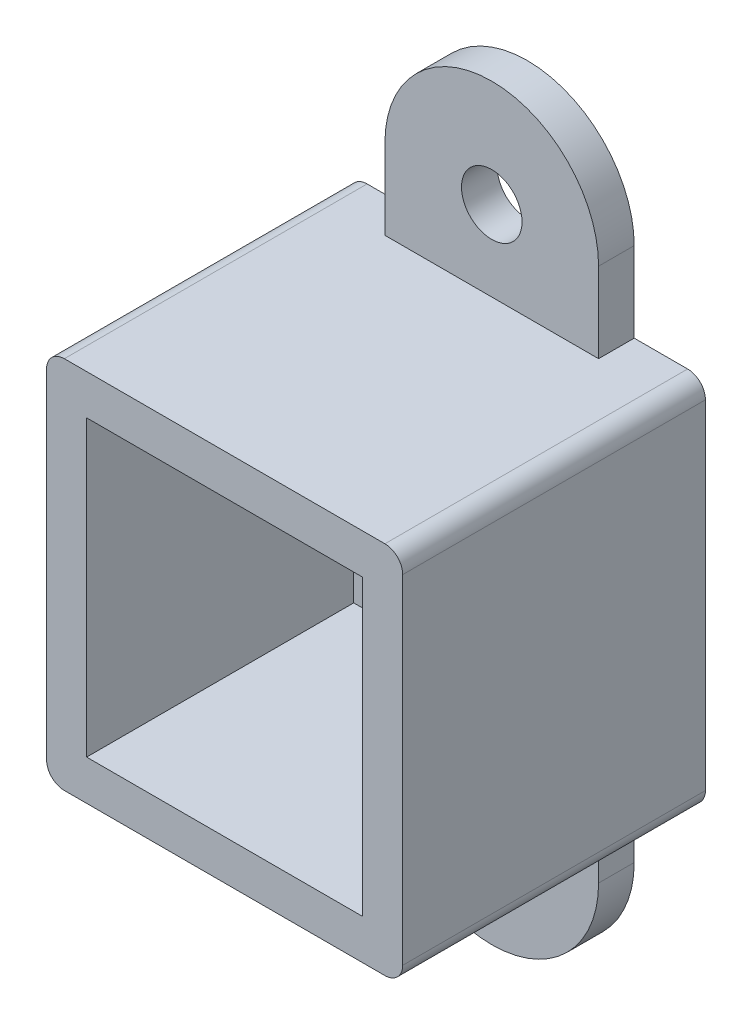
from build123d import *

# Parameters (mm, degrees)
SKETCH1_W            = 20
SKETCH1_H            = 21
SKETCH1_W_2          = 15.5
SKETCH1_H_2          = 16.5
BOSS_EXTRUDE2_DEPTH  = 17
BOSS_EXTRUDE3_DEPTH  = 2
M3_CLEARANCE_HOLE1_D = 3.4
FILLET1_R            = 1


with BuildPart() as part:
    # Sketch1 → Boss-Extrude2 (new body)
    with BuildSketch(Plane.XY):
        Rectangle(SKETCH1_W, SKETCH1_H)
        Rectangle(SKETCH1_W_2, SKETCH1_H_2, mode=Mode.SUBTRACT)
    extrude(amount=BOSS_EXTRUDE2_DEPTH)

    # Sketch2 → Boss-Extrude3 (add)
    with BuildSketch(Plane(origin=(0, 0, 0), x_dir=(-1, 0, 0), z_dir=(0, 0, -1))):
        with BuildLine():
            Line((-6, 10.5), (-6, 15))
            ThreePointArc((-6, 15), (0, 21), (6, 15))
            Line((6, 15), (6, 10.5))
            Line((6, 10.5), (10, 10.5))
            Line((10, 10.5), (10, -10.5))
            Line((10, -10.5), (6, -10.5))
            Line((6, -10.5), (6, -15))
            ThreePointArc((6, -15), (0, -21), (-6, -15))
            Line((-6, -15), (-6, -10.5))
            Line((-6, -10.5), (-10, -10.5))
            Line((-10, -10.5), (-10, 10.5))
            Line((-10, 10.5), (-6, 10.5))
        make_face()
    extrude(amount=-BOSS_EXTRUDE3_DEPTH)

    # M3 Clearance Hole1 (through all)
    with Locations(Plane.XY.offset(2)):
        with Locations((0, 15), (0, -15)):
            Hole(M3_CLEARANCE_HOLE1_D / 2)

    # Fillet1
    fillet1_edges = [part.edges().sort_by_distance(p)[0] for p in [
        (10, -10.5, 8.5),
        (-10, -10.5, 8.5),
        (-10, 10.5, 8.5),
        (10, 10.5, 8.5),
    ]]
    fillet(fillet1_edges, radius=FILLET1_R)


solid = part.part
